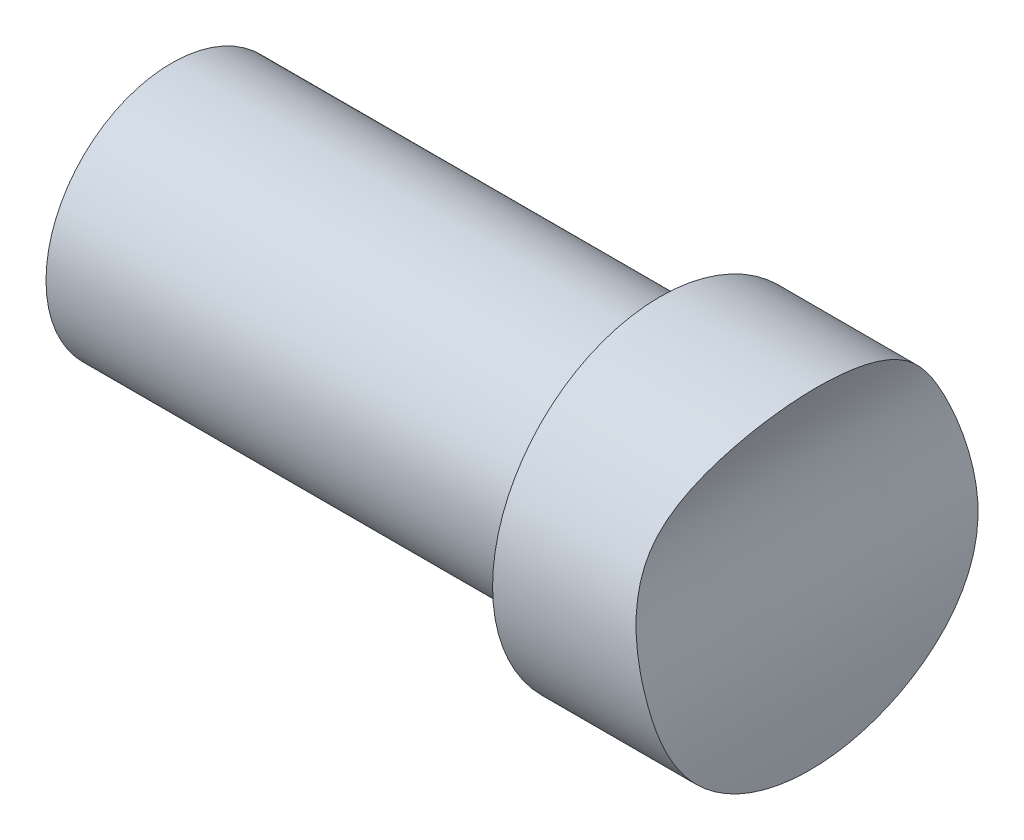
ISO-10303-21;
HEADER;
FILE_DESCRIPTION(('STEP AP214'),'2;1');
FILE_NAME('part.step','',(''),(''),'','','');
FILE_SCHEMA(('AUTOMOTIVE_DESIGN { 1 0 10303 214 1 1 1 1 }'));
ENDSEC;
DATA;
#1=APPLICATION_CONTEXT('core data for automotive mechanical design processes');
#2=APPLICATION_PROTOCOL_DEFINITION('international standard','automotive_design',2000,#1);
#3=PRODUCT_CONTEXT('',#1,'mechanical');
#4=PRODUCT('Part','Part','',(#3));
#5=PRODUCT_RELATED_PRODUCT_CATEGORY('part','',(#4));
#6=PRODUCT_DEFINITION_FORMATION('','',#4);
#7=PRODUCT_DEFINITION_CONTEXT('part definition',#1,'design');
#8=PRODUCT_DEFINITION('design','',#6,#7);
#9=PRODUCT_DEFINITION_SHAPE('','',#8);
#10=(LENGTH_UNIT() NAMED_UNIT(*) SI_UNIT(.MILLI.,.METRE.));
#11=(NAMED_UNIT(*) PLANE_ANGLE_UNIT() SI_UNIT($,.RADIAN.));
#12=(NAMED_UNIT(*) SI_UNIT($,.STERADIAN.) SOLID_ANGLE_UNIT());
#13=UNCERTAINTY_MEASURE_WITH_UNIT(LENGTH_MEASURE(1.E-05),#10,'distance_accuracy_value','');
#14=(GEOMETRIC_REPRESENTATION_CONTEXT(3) GLOBAL_UNCERTAINTY_ASSIGNED_CONTEXT((#13)) GLOBAL_UNIT_ASSIGNED_CONTEXT((#10,
#11,#12)) REPRESENTATION_CONTEXT('',''));
#15=CARTESIAN_POINT('',(0.,0.,0.));
#16=DIRECTION('',(0.,0.,1.));
#17=DIRECTION('',(1.,0.,0.));
#18=AXIS2_PLACEMENT_3D('',#15,#16,#17);
#19=CARTESIAN_POINT('',(0.,0.,0.));
#20=DIRECTION('',(1.,0.,0.));
#21=DIRECTION('',(0.,0.,-1.));
#22=AXIS2_PLACEMENT_3D('',#19,#20,#21);
#23=PLANE('',#22);
#24=CARTESIAN_POINT('',(0.,0.,0.));
#25=DIRECTION('',(-1.,0.,0.));
#26=DIRECTION('',(0.,0.,1.));
#27=AXIS2_PLACEMENT_3D('',#24,#25,#26);
#28=CIRCLE('',#27,3.39999999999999);
#29=CARTESIAN_POINT('',(0.,0.,3.39999999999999));
#30=VERTEX_POINT('',#29);
#31=EDGE_CURVE('E55',#30,#30,#28,.T.);
#32=ORIENTED_EDGE('',*,*,#31,.F.);
#33=EDGE_LOOP('',(#32));
#34=FACE_BOUND('',#33,.T.);
#35=CARTESIAN_POINT('',(0.,0.,0.));
#36=DIRECTION('',(-1.,0.,0.));
#37=DIRECTION('',(0.,0.,1.));
#38=AXIS2_PLACEMENT_3D('',#35,#36,#37);
#39=CIRCLE('',#38,9.);
#40=CARTESIAN_POINT('',(0.,0.,9.));
#41=VERTEX_POINT('',#40);
#42=EDGE_CURVE('E11',#41,#41,#39,.T.);
#43=ORIENTED_EDGE('',*,*,#42,.T.);
#44=EDGE_LOOP('',(#43));
#45=FACE_BOUND('',#44,.T.);
#46=ADVANCED_FACE('F31',(#34,#45),#23,.F.);
#47=CARTESIAN_POINT('',(-8.99583333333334,0.,0.));
#48=DIRECTION('',(-1.,0.,0.));
#49=DIRECTION('',(0.,0.,1.));
#50=AXIS2_PLACEMENT_3D('',#47,#48,#49);
#51=CYLINDRICAL_SURFACE('',#50,9.);
#52=ORIENTED_EDGE('',*,*,#42,.F.);
#53=EDGE_LOOP('',(#52));
#54=FACE_BOUND('',#53,.T.);
#55=CARTESIAN_POINT('',(35.,0.,1.2490009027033E-13));
#56=DIRECTION('',(-1.,0.,0.));
#57=DIRECTION('',(0.,0.,1.));
#58=AXIS2_PLACEMENT_3D('',#55,#56,#57);
#59=CIRCLE('',#58,9.);
#60=CARTESIAN_POINT('',(35.,0.,9.00000000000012));
#61=VERTEX_POINT('',#60);
#62=EDGE_CURVE('E42',#61,#61,#59,.T.);
#63=ORIENTED_EDGE('',*,*,#62,.T.);
#64=EDGE_LOOP('',(#63));
#65=FACE_BOUND('',#64,.T.);
#66=ADVANCED_FACE('F71',(#54,#65),#51,.T.);
#67=CARTESIAN_POINT('',(35.,9.00000000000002,1.17961196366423E-13));
#68=DIRECTION('',(1.,0.,0.));
#69=DIRECTION('',(0.,0.,-1.));
#70=AXIS2_PLACEMENT_3D('',#67,#68,#69);
#71=PLANE('',#70);
#72=ORIENTED_EDGE('',*,*,#62,.F.);
#73=EDGE_LOOP('',(#72));
#74=FACE_BOUND('',#73,.T.);
#75=CARTESIAN_POINT('',(35.,0.,1.2490009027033E-13));
#76=DIRECTION('',(-1.,0.,0.));
#77=DIRECTION('',(0.,0.,1.));
#78=AXIS2_PLACEMENT_3D('',#75,#76,#77);
#79=CIRCLE('',#78,12.);
#80=CARTESIAN_POINT('',(35.,0.,12.0000000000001));
#81=VERTEX_POINT('',#80);
#82=EDGE_CURVE('E58',#81,#81,#79,.T.);
#83=ORIENTED_EDGE('',*,*,#82,.T.);
#84=EDGE_LOOP('',(#83));
#85=FACE_BOUND('',#84,.T.);
#86=ADVANCED_FACE('F73',(#74,#85),#71,.F.);
#87=CARTESIAN_POINT('',(-8.99583333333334,0.,0.));
#88=DIRECTION('',(-1.,0.,0.));
#89=DIRECTION('',(0.,0.,1.));
#90=AXIS2_PLACEMENT_3D('',#87,#88,#89);
#91=CYLINDRICAL_SURFACE('',#90,12.);
#92=CARTESIAN_POINT('',(45.5788103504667,0.,12.0000000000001));
#93=CARTESIAN_POINT('',(45.5111481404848,0.306215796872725,12.0000005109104));
#94=CARTESIAN_POINT('',(45.440789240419,0.611901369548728,11.9882845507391));
#95=CARTESIAN_POINT('',(45.2997339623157,1.22155497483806,11.9415804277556));
#96=CARTESIAN_POINT('',(45.2290374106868,1.52552189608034,11.9065786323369));
#97=CARTESIAN_POINT('',(45.0921790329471,2.13145183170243,11.8131714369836));
#98=CARTESIAN_POINT('',(45.0260249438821,2.43341067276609,11.7547272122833));
#99=CARTESIAN_POINT('',(44.9032676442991,3.03372141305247,11.6142793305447));
#100=CARTESIAN_POINT('',(44.8466608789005,3.33207461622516,11.5322844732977));
#101=CARTESIAN_POINT('',(44.7555864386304,3.87585253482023,11.3598169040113));
#102=CARTESIAN_POINT('',(44.7190192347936,4.12203785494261,11.2728564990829));
#103=CARTESIAN_POINT('',(44.6582271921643,4.6095399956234,11.0824459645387));
#104=CARTESIAN_POINT('',(44.6340020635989,4.85085693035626,10.9789962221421));
#105=CARTESIAN_POINT('',(44.5999008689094,5.326411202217,10.7563025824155));
#106=CARTESIAN_POINT('',(44.5899861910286,5.5606659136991,10.6371021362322));
#107=CARTESIAN_POINT('',(44.586708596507,5.90580138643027,10.446951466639));
#108=CARTESIAN_POINT('',(44.5875486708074,6.01980882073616,10.3816740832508));
#109=CARTESIAN_POINT('',(44.5931486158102,6.24555407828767,10.2474527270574));
#110=CARTESIAN_POINT('',(44.5979083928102,6.35729195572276,10.1785088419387));
#111=CARTESIAN_POINT('',(44.6114007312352,6.57805587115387,10.0372468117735));
#112=CARTESIAN_POINT('',(44.6201254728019,6.6870868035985,9.96493555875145));
#113=CARTESIAN_POINT('',(44.6413202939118,6.90248009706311,9.81696706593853));
#114=CARTESIAN_POINT('',(44.6537904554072,7.0088423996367,9.74130975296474));
#115=CARTESIAN_POINT('',(44.6819297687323,7.21879058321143,9.58676463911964));
#116=CARTESIAN_POINT('',(44.6975995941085,7.3223758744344,9.50787616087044));
#117=CARTESIAN_POINT('',(44.7316747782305,7.52664383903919,9.34700685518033));
#118=CARTESIAN_POINT('',(44.7500801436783,7.62732650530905,9.26502602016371));
#119=CARTESIAN_POINT('',(44.8088244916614,7.9254754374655,9.0141242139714));
#120=CARTESIAN_POINT('',(44.8526110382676,8.11847625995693,8.84066128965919));
#121=CARTESIAN_POINT('',(44.9460761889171,8.49207417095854,8.48243353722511));
#122=CARTESIAN_POINT('',(44.9957547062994,8.67267144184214,8.29766887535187));
#123=CARTESIAN_POINT('',(45.1048000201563,9.04350614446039,7.89301174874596));
#124=CARTESIAN_POINT('',(45.1645929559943,9.23201827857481,7.67165022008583));
#125=CARTESIAN_POINT('',(45.2848416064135,9.59241436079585,7.21595320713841));
#126=CARTESIAN_POINT('',(45.3452973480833,9.76429762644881,6.98161719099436));
#127=CARTESIAN_POINT('',(45.4641433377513,10.090720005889,6.50090018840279));
#128=CARTESIAN_POINT('',(45.5225350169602,10.2452713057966,6.25452784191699));
#129=CARTESIAN_POINT('',(45.6351479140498,10.5364507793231,5.75047224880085));
#130=CARTESIAN_POINT('',(45.6893688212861,10.6730776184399,5.49278816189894));
#131=CARTESIAN_POINT('',(45.801068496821,10.950252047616,4.92039098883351));
#132=CARTESIAN_POINT('',(45.8574109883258,11.0871735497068,4.60368739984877));
#133=CARTESIAN_POINT('',(45.9598914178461,11.3336800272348,3.95816548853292));
#134=CARTESIAN_POINT('',(46.0060281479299,11.4432617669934,3.62934573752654));
#135=CARTESIAN_POINT('',(46.0867069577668,11.6338561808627,2.96205981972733));
#136=CARTESIAN_POINT('',(46.1212470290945,11.7148639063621,2.62359199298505));
#137=CARTESIAN_POINT('',(46.1778422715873,11.8472774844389,1.93990371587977));
#138=CARTESIAN_POINT('',(46.199898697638,11.8986863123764,1.59468394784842));
#139=CARTESIAN_POINT('',(46.2297877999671,11.9682985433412,0.928773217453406));
#140=CARTESIAN_POINT('',(46.2386318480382,11.9888635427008,0.60837213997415));
#141=CARTESIAN_POINT('',(46.2452444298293,12.0042422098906,-0.0331536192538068));
#142=CARTESIAN_POINT('',(46.2430135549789,11.9990572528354,-0.354278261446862));
#143=CARTESIAN_POINT('',(46.2275157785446,11.9630024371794,-0.994682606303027));
#144=CARTESIAN_POINT('',(46.2142532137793,11.9321426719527,-1.31396298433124));
#145=CARTESIAN_POINT('',(46.1769241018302,11.8450931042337,-1.94840714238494));
#146=CARTESIAN_POINT('',(46.1528576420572,11.7889035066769,-2.26357095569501));
#147=CARTESIAN_POINT('',(46.0953030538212,11.6539560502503,-2.87767748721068));
#148=CARTESIAN_POINT('',(46.062134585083,11.5759624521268,-3.17681877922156));
#149=CARTESIAN_POINT('',(45.9867897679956,11.3975291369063,-3.76714868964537));
#150=CARTESIAN_POINT('',(45.944613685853,11.297090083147,-4.0583375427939));
#151=CARTESIAN_POINT('',(45.8522689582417,11.0746052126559,-4.63115321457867));
#152=CARTESIAN_POINT('',(45.8020969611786,10.9525503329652,-4.9127759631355));
#153=CARTESIAN_POINT('',(45.6952110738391,10.6877930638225,-5.46487009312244));
#154=CARTESIAN_POINT('',(45.6384969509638,10.5450899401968,-5.73534107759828));
#155=CARTESIAN_POINT('',(45.5381604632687,10.2856875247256,-6.18468576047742));
#156=CARTESIAN_POINT('',(45.4957026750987,10.1739957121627,-6.36673730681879));
#157=CARTESIAN_POINT('',(45.4093662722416,9.9412216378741,-6.7244059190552));
#158=CARTESIAN_POINT('',(45.3654876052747,9.82013903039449,-6.90002274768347));
#159=CARTESIAN_POINT('',(45.2772824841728,9.56884100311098,-7.24449750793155));
#160=CARTESIAN_POINT('',(45.2329559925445,9.43862481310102,-7.41335486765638));
#161=CARTESIAN_POINT('',(45.1449949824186,9.1692762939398,-7.7440201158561));
#162=CARTESIAN_POINT('',(45.1013605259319,9.03014317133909,-7.90582737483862));
#163=CARTESIAN_POINT('',(45.0161160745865,8.7431747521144,-8.22207298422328));
#164=CARTESIAN_POINT('',(44.9745059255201,8.59534012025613,-8.37651189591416));
#165=CARTESIAN_POINT('',(44.894835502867,8.29113292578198,-8.67772593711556));
#166=CARTESIAN_POINT('',(44.8567751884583,8.13476046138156,-8.82450115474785));
#167=CARTESIAN_POINT('',(44.7924273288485,7.84300696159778,-9.08394618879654));
#168=CARTESIAN_POINT('',(44.7652590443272,7.70900563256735,-9.19795038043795));
#169=CARTESIAN_POINT('',(44.7155547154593,7.43561576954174,-9.42033210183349));
#170=CARTESIAN_POINT('',(44.6930177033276,7.29622836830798,-9.52871080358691));
#171=CARTESIAN_POINT('',(44.6537191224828,7.01229616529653,-9.73955652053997));
#172=CARTESIAN_POINT('',(44.6369562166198,6.86775256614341,-9.84202489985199));
#173=CARTESIAN_POINT('',(44.61057330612,6.5742196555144,-10.0404644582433));
#174=CARTESIAN_POINT('',(44.6009334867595,6.42524388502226,-10.1364529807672));
#175=CARTESIAN_POINT('',(44.5888891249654,6.1229355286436,-10.3218752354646));
#176=CARTESIAN_POINT('',(44.5864862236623,5.96960196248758,-10.4113074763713));
#177=CARTESIAN_POINT('',(44.5887219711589,5.65917158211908,-10.5832543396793));
#178=CARTESIAN_POINT('',(44.5933605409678,5.50207481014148,-10.6657690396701));
#179=CARTESIAN_POINT('',(44.6133529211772,5.10558549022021,-10.8629397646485));
#180=CARTESIAN_POINT('',(44.632892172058,4.86416582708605,-10.9731411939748));
#181=CARTESIAN_POINT('',(44.6853038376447,4.37585837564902,-11.1768464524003));
#182=CARTESIAN_POINT('',(44.7181764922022,4.12897048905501,-11.270349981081));
#183=CARTESIAN_POINT('',(44.7950246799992,3.6303538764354,-11.4407241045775));
#184=CARTESIAN_POINT('',(44.839035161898,3.37861226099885,-11.5175409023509));
#185=CARTESIAN_POINT('',(44.9353882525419,2.87215168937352,-11.6541649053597));
#186=CARTESIAN_POINT('',(44.9877313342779,2.6174325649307,-11.7139711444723));
#187=CARTESIAN_POINT('',(45.1025696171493,2.08383611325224,-11.8210787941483));
#188=CARTESIAN_POINT('',(45.1655505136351,1.8047607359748,-11.8668675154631));
#189=CARTESIAN_POINT('',(45.2940763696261,1.24465236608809,-11.9386167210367));
#190=CARTESIAN_POINT('',(45.3596215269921,0.963619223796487,-11.9645756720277));
#191=CARTESIAN_POINT('',(45.4892617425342,0.40051070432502,-11.9966252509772));
#192=CARTESIAN_POINT('',(45.5533587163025,0.118437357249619,-12.0027438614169));
#193=CARTESIAN_POINT('',(45.6762204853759,-0.446660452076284,-11.9950116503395));
#194=CARTESIAN_POINT('',(45.7349854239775,-0.729684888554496,-11.9811613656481));
#195=CARTESIAN_POINT('',(45.8109390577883,-1.1272204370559,-11.9474928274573));
#196=CARTESIAN_POINT('',(45.8320520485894,-1.24174399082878,-11.9361362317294));
#197=CARTESIAN_POINT('',(45.8724619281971,-1.47073077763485,-11.9100894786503));
#198=CARTESIAN_POINT('',(45.8917588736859,-1.58519401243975,-11.8953994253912));
#199=CARTESIAN_POINT('',(45.9466471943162,-1.92839295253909,-11.8462946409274));
#200=CARTESIAN_POINT('',(45.979231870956,-2.15691638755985,-11.8068470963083));
#201=CARTESIAN_POINT('',(46.0369067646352,-2.61217780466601,-11.7145419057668));
#202=CARTESIAN_POINT('',(46.0619967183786,-2.83891572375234,-11.6616837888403));
#203=CARTESIAN_POINT('',(46.1052635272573,-3.28971682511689,-11.5426232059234));
#204=CARTESIAN_POINT('',(46.1234350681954,-3.51377782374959,-11.4764105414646));
#205=CARTESIAN_POINT('',(46.1535167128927,-3.95803149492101,-11.3308704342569));
#206=CARTESIAN_POINT('',(46.1654265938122,-4.1782240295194,-11.2515425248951));
#207=CARTESIAN_POINT('',(46.1837128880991,-4.61375646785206,-11.0800736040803));
#208=CARTESIAN_POINT('',(46.1900898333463,-4.82909683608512,-10.9879338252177));
#209=CARTESIAN_POINT('',(46.1992812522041,-5.31860105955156,-10.7613020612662));
#210=CARTESIAN_POINT('',(46.2004275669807,-5.59078667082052,-10.6224425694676));
#211=CARTESIAN_POINT('',(46.1962818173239,-6.12367100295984,-10.3244302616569));
#212=CARTESIAN_POINT('',(46.1909907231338,-6.384371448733,-10.1652805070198));
#213=CARTESIAN_POINT('',(46.1755685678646,-6.89275595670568,-9.82766544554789));
#214=CARTESIAN_POINT('',(46.1654380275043,-7.1404414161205,-9.64920221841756));
#215=CARTESIAN_POINT('',(46.141798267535,-7.62141022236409,-9.27400406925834));
#216=CARTESIAN_POINT('',(46.1282887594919,-7.85469233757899,-9.07726758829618));
#217=CARTESIAN_POINT('',(46.0980311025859,-8.32349077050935,-8.65030920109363));
#218=CARTESIAN_POINT('',(46.0811107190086,-8.55770562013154,-8.41866833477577));
#219=CARTESIAN_POINT('',(46.0462437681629,-9.00627431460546,-7.93696093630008));
#220=CARTESIAN_POINT('',(46.028297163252,-9.22062743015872,-7.68689372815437));
#221=CARTESIAN_POINT('',(45.9925195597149,-9.62809335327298,-7.1699472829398));
#222=CARTESIAN_POINT('',(45.9746885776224,-9.82120318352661,-6.90306569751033));
#223=CARTESIAN_POINT('',(45.9400484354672,-10.1848608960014,-6.35428698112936));
#224=CARTESIAN_POINT('',(45.9232392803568,-10.3554086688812,-6.07238977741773));
#225=CARTESIAN_POINT('',(45.8909121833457,-10.6769103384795,-5.48795752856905));
#226=CARTESIAN_POINT('',(45.8754390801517,-10.8272407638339,-5.18507672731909));
#227=CARTESIAN_POINT('',(45.8468186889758,-11.1018500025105,-4.56761408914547));
#228=CARTESIAN_POINT('',(45.8336714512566,-11.2261282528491,-4.25303199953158));
#229=CARTESIAN_POINT('',(45.8100602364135,-11.4477229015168,-3.61439920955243));
#230=CARTESIAN_POINT('',(45.7995963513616,-11.5450383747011,-3.29034818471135));
#231=CARTESIAN_POINT('',(45.7815783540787,-11.7119800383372,-2.63511336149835));
#232=CARTESIAN_POINT('',(45.7740242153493,-11.7816064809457,-2.30392962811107));
#233=CARTESIAN_POINT('',(45.761987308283,-11.8923660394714,-1.63853510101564));
#234=CARTESIAN_POINT('',(45.7574888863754,-11.9336443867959,-1.30434875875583));
#235=CARTESIAN_POINT('',(45.7515650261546,-11.9879799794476,-0.633662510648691));
#236=CARTESIAN_POINT('',(45.7501395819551,-12.001037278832,-0.297162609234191));
#237=CARTESIAN_POINT('',(45.7503799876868,-11.9988341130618,0.375732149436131));
#238=CARTESIAN_POINT('',(45.752045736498,-11.983574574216,0.712127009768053));
#239=CARTESIAN_POINT('',(45.7584468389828,-11.9248525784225,1.38241615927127));
#240=CARTESIAN_POINT('',(45.7631821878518,-11.8813901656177,1.7163104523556));
#241=CARTESIAN_POINT('',(45.775635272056,-11.7667575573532,2.37821153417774));
#242=CARTESIAN_POINT('',(45.7833439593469,-11.6956714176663,2.70623305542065));
#243=CARTESIAN_POINT('',(45.8016112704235,-11.5263070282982,3.35509658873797));
#244=CARTESIAN_POINT('',(45.8121698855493,-11.4280288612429,3.6759386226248));
#245=CARTESIAN_POINT('',(45.8359093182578,-11.2049982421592,4.30817586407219));
#246=CARTESIAN_POINT('',(45.8490900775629,-11.0802463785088,4.61957128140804));
#247=CARTESIAN_POINT('',(45.8777164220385,-10.8051663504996,5.23074392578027));
#248=CARTESIAN_POINT('',(45.8931620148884,-10.6548380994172,5.53052111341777));
#249=CARTESIAN_POINT('',(45.9258357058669,-10.3292387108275,6.11716197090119));
#250=CARTESIAN_POINT('',(45.943068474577,-10.1539017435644,6.40398884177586));
#251=CARTESIAN_POINT('',(45.9785438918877,-9.77982378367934,6.9618851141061));
#252=CARTESIAN_POINT('',(45.9967865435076,-9.58108272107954,7.23295446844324));
#253=CARTESIAN_POINT('',(46.0333064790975,-9.16153347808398,7.75752044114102));
#254=CARTESIAN_POINT('',(46.0515837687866,-8.94072127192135,8.0110138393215));
#255=CARTESIAN_POINT('',(46.0869272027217,-8.47856475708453,8.49863407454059));
#256=CARTESIAN_POINT('',(46.1039933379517,-8.23722029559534,8.73276076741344));
#257=CARTESIAN_POINT('',(46.1354922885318,-7.7341444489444,9.18135411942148));
#258=CARTESIAN_POINT('',(46.1499088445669,-7.47230038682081,9.39569561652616));
#259=CARTESIAN_POINT('',(46.1741687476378,-6.93130083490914,9.80160293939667));
#260=CARTESIAN_POINT('',(46.1840120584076,-6.65214520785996,9.99316858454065));
#261=CARTESIAN_POINT('',(46.1970734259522,-6.07850266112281,10.3521160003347));
#262=CARTESIAN_POINT('',(46.2002907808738,-5.78401412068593,10.5194952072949));
#263=CARTESIAN_POINT('',(46.1978658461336,-5.18192416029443,10.8287646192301));
#264=CARTESIAN_POINT('',(46.1922237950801,-4.87432309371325,10.9706555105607));
#265=CARTESIAN_POINT('',(46.1737231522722,-4.35825591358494,11.1827520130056));
#266=CARTESIAN_POINT('',(46.1640841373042,-4.15280114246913,11.2606593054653));
#267=CARTESIAN_POINT('',(46.1394867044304,-3.73819275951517,11.4050022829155));
#268=CARTESIAN_POINT('',(46.1245283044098,-3.52903916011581,11.4714380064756));
#269=CARTESIAN_POINT('',(46.0887176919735,-3.10787248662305,11.5926337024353));
#270=CARTESIAN_POINT('',(46.0678653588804,-2.89585935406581,11.6473934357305));
#271=CARTESIAN_POINT('',(46.0197992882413,-2.47034363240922,11.7449956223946));
#272=CARTESIAN_POINT('',(45.9926009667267,-2.25684585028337,11.7878664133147));
#273=CARTESIAN_POINT('',(45.9467153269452,-1.93583838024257,11.8433242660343));
#274=CARTESIAN_POINT('',(45.9305719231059,-1.82870814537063,11.8603356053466));
#275=CARTESIAN_POINT('',(45.8965192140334,-1.61430157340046,11.8914155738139));
#276=CARTESIAN_POINT('',(45.8786098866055,-1.50702523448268,11.9054841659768));
#277=CARTESIAN_POINT('',(45.8224692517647,-1.18523725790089,11.9432759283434));
#278=CARTESIAN_POINT('',(45.7818024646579,-0.970608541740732,11.9626123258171));
#279=CARTESIAN_POINT('',(45.7261666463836,-0.693058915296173,11.9801363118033));
#280=CARTESIAN_POINT('',(45.7133211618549,-0.629993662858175,11.983617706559));
#281=CARTESIAN_POINT('',(45.6872714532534,-0.503899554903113,11.9895816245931));
#282=CARTESIAN_POINT('',(45.6740672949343,-0.440870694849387,11.9920643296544));
#283=CARTESIAN_POINT('',(45.633979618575,-0.251828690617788,11.9980199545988));
#284=CARTESIAN_POINT('',(45.6066228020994,-0.125869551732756,11.9999997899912));
#285=CARTESIAN_POINT('',(45.5788103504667,0.,12.0000000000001));
#286=B_SPLINE_CURVE_WITH_KNOTS('',3,(#92,#93,#94,#95,#96,#97,#98,#99,#100,#101,#102,#103,#104,
#105,#106,#107,#108,#109,#110,#111,#112,#113,#114,#115,#116,#117,#118,#119,#120,#121,#122,#123,
#124,#125,#126,#127,#128,#129,#130,#131,#132,#133,#134,#135,#136,#137,#138,#139,#140,#141,#142,
#143,#144,#145,#146,#147,#148,#149,#150,#151,#152,#153,#154,#155,#156,#157,#158,#159,#160,#161,
#162,#163,#164,#165,#166,#167,#168,#169,#170,#171,#172,#173,#174,#175,#176,#177,#178,#179,#180,
#181,#182,#183,#184,#185,#186,#187,#188,#189,#190,#191,#192,#193,#194,#195,#196,#197,#198,#199,
#200,#201,#202,#203,#204,#205,#206,#207,#208,#209,#210,#211,#212,#213,#214,#215,#216,#217,#218,
#219,#220,#221,#222,#223,#224,#225,#226,#227,#228,#229,#230,#231,#232,#233,#234,#235,#236,#237,
#238,#239,#240,#241,#242,#243,#244,#245,#246,#247,#248,#249,#250,#251,#252,#253,#254,#255,#256,
#257,#258,#259,#260,#261,#262,#263,#264,#265,#266,#267,#268,#269,#270,#271,#272,#273,#274,#275,
#276,#277,#278,#279,#280,#281,#282,#283,#284,#285),.UNSPECIFIED.,.T.,.F.,(4,2,2,2,2,2,2,2,2,2,2,
2,2,2,2,2,2,2,2,2,2,2,2,2,2,2,2,2,2,2,2,2,2,2,2,2,2,2,2,2,2,2,2,2,2,2,2,2,2,2,2,2,2,2,2,2,2,2,2,
2,2,2,2,2,2,2,2,2,2,2,2,2,2,2,2,2,2,2,2,2,2,2,2,2,2,2,2,2,2,2,2,2,2,2,2,2,4),(0.,
0.940712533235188,1.88197628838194,2.82480542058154,3.76728271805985,4.55742803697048,
5.34755480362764,6.13554567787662,6.52956510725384,6.92357511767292,7.31681139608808,
7.71005627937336,8.10338402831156,8.49671274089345,9.28548930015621,10.0742542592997,
10.9639883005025,11.8537588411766,12.7428998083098,13.6321069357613,14.679495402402,
15.7270077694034,16.7747014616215,17.8222898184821,18.7846336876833,19.7469261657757,
20.7088405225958,21.6707470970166,22.602441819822,23.5341090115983,24.4661677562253,
25.3982596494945,26.0512664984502,26.7042974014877,27.3573834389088,28.0105276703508,
28.6636220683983,29.3167089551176,29.8505629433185,30.3843052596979,30.9179238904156,
31.4500524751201,31.9823017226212,32.5145449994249,33.3118135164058,34.1090963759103,
34.9089126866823,35.7087744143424,36.5772468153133,37.4457863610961,38.3131003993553,
39.1803911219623,39.5313592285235,39.8823163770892,40.5842964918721,41.2863012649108,
41.9888441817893,42.6914120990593,43.3939124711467,44.3095795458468,45.2251086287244,
46.1405392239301,47.0560479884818,48.0444626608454,49.0329136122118,50.0215029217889,
51.0100970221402,52.0243508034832,53.0386265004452,54.052936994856,55.0672382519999,
56.0763035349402,57.0853668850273,58.0943972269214,59.103425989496,60.1094081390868,
61.1153872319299,62.1213439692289,63.1273041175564,64.1359628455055,65.1446245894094,
66.1534706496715,67.1623242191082,68.1771757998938,69.192035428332,70.2070025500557,
71.2219423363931,71.881413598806,72.5408826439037,73.2003651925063,73.8582620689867,
74.1872162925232,74.5161746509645,75.1736059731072,75.3669659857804,75.5602907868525,
75.9469692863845),.UNSPECIFIED.);
#287=CARTESIAN_POINT('',(45.5788103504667,0.,12.0000000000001));
#288=VERTEX_POINT('',#287);
#289=EDGE_CURVE('E34',#288,#288,#286,.T.);
#290=ORIENTED_EDGE('',*,*,#289,.T.);
#291=EDGE_LOOP('',(#290));
#292=FACE_BOUND('',#291,.T.);
#293=ORIENTED_EDGE('',*,*,#82,.F.);
#294=EDGE_LOOP('',(#293));
#295=FACE_BOUND('',#294,.T.);
#296=ADVANCED_FACE('F76',(#292,#295),#91,.T.);
#297=CARTESIAN_POINT('',(0.,0.,0.));
#298=DIRECTION('',(-1.,0.,0.));
#299=DIRECTION('',(0.,0.,1.));
#300=AXIS2_PLACEMENT_3D('',#297,#298,#299);
#301=CYLINDRICAL_SURFACE('',#300,3.39999999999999);
#302=CARTESIAN_POINT('',(27.,0.,1.2490009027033E-13));
#303=DIRECTION('',(-1.,0.,0.));
#304=DIRECTION('',(0.,0.,1.));
#305=AXIS2_PLACEMENT_3D('',#302,#303,#304);
#306=CIRCLE('',#305,3.39999999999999);
#307=CARTESIAN_POINT('',(27.,0.,3.40000000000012));
#308=VERTEX_POINT('',#307);
#309=EDGE_CURVE('E53',#308,#308,#306,.T.);
#310=ORIENTED_EDGE('',*,*,#309,.F.);
#311=EDGE_LOOP('',(#310));
#312=FACE_BOUND('',#311,.T.);
#313=ORIENTED_EDGE('',*,*,#31,.T.);
#314=EDGE_LOOP('',(#313));
#315=FACE_BOUND('',#314,.T.);
#316=ADVANCED_FACE('F49',(#312,#315),#301,.F.);
#317=CARTESIAN_POINT('',(27.,0.,1.2490009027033E-13));
#318=DIRECTION('',(-1.,0.,0.));
#319=DIRECTION('',(0.,0.,1.));
#320=AXIS2_PLACEMENT_3D('',#317,#318,#319);
#321=CONICAL_SURFACE('',#320,3.39999999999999,1.02974425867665);
#322=CARTESIAN_POINT('',(29.0429261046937,0.,1.2490009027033E-13));
#323=VERTEX_POINT('',#322);
#324=VERTEX_LOOP('',#323);
#325=FACE_BOUND('',#324,.T.);
#326=ORIENTED_EDGE('',*,*,#309,.T.);
#327=EDGE_LOOP('',(#326));
#328=FACE_BOUND('',#327,.T.);
#329=ADVANCED_FACE('F45',(#325,#328),#321,.F.);
#330=CARTESIAN_POINT('',(46.4342592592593,12.4423400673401,-14.9999999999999));
#331=CARTESIAN_POINT('',(45.6072999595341,10.5286891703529,-14.9999999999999));
#332=CARTESIAN_POINT('',(43.6385193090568,5.97277105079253,-14.9999999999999));
#333=CARTESIAN_POINT('',(46.797982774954,-2.45128221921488,-14.9999999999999));
#334=CARTESIAN_POINT('',(46.0931024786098,-8.87598625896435,-14.9999999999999));
#335=CARTESIAN_POINT('',(45.6944444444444,-12.5095959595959,-14.9999999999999));
#336=B_SPLINE_CURVE_WITH_KNOTS('',3,(#330,#331,#332,#333,#334,#335),.UNSPECIFIED.,.F.,.F.,(4,1,
1,4),(0.,0.239332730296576,0.569790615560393,1.),.UNSPECIFIED.);
#337=DIRECTION('',(0.,0.,1.));
#338=VECTOR('',#337,1.);
#339=SURFACE_OF_LINEAR_EXTRUSION('',#336,#338);
#340=ORIENTED_EDGE('',*,*,#289,.F.);
#341=EDGE_LOOP('',(#340));
#342=FACE_BOUND('',#341,.T.);
#343=ADVANCED_FACE('F48',(#342),#339,.F.);
#344=CLOSED_SHELL('',(#46,#66,#86,#296,#316,#329,#343));
#345=MANIFOLD_SOLID_BREP('B2',#344);
#346=ADVANCED_BREP_SHAPE_REPRESENTATION('',(#18,#345),#14);
#347=SHAPE_DEFINITION_REPRESENTATION(#9,#346);
ENDSEC;
END-ISO-10303-21;
